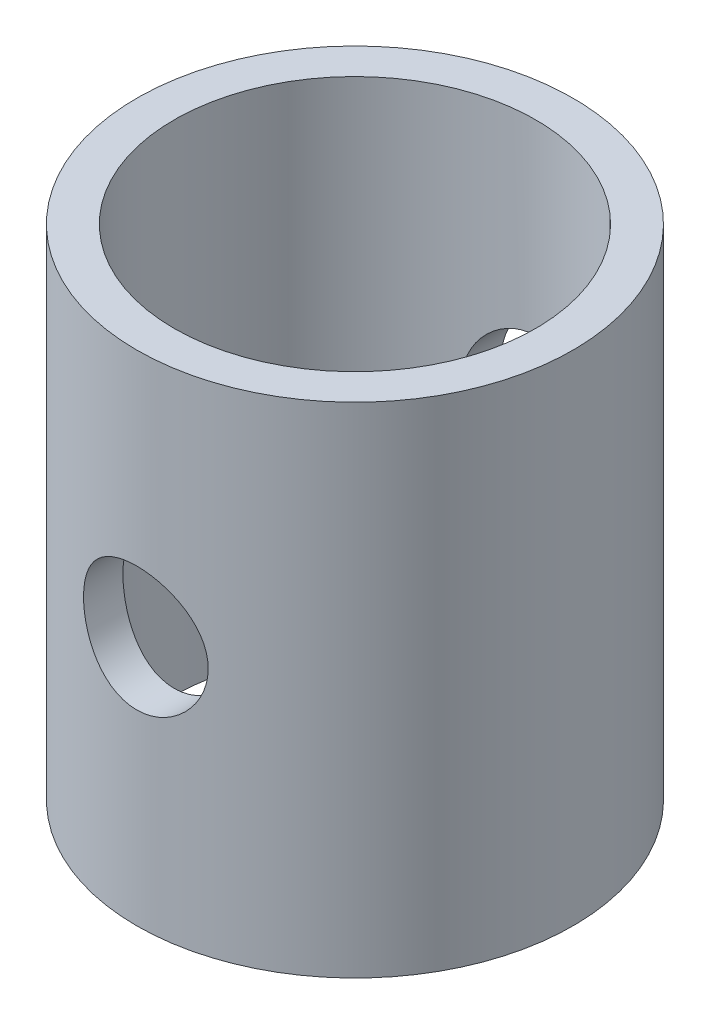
from build123d import *

# Parameters (mm, degrees)
SKETCH1_R          = 17.5
SKETCH1_R_2        = 14.5
EXTRUDE1_DEPTH     = 20
SKETCH2_R          = 5
CUT_EXTRUDE1_DEPTH = 20


with BuildPart() as part:
    # Sketch1 → Extrude1 (new, symmetric)
    with BuildSketch(Plane(origin=(0, 0, 0), x_dir=(1, 0, 0), z_dir=(0, 1, 0))):
        with Locations(Location((0, 0, 0), (0, 0, 270))):
            Circle(SKETCH1_R)
        with Locations(Location((0, 0, 0), (0, 0, 270))):
            Circle(SKETCH1_R_2, mode=Mode.SUBTRACT)
    extrude(amount=EXTRUDE1_DEPTH, both=True)

    # Sketch2 → Cut-Extrude1 (cut, symmetric)
    with BuildSketch(Plane.XY):
        Circle(SKETCH2_R)
    extrude(amount=CUT_EXTRUDE1_DEPTH, both=True, mode=Mode.SUBTRACT)


solid = part.part
